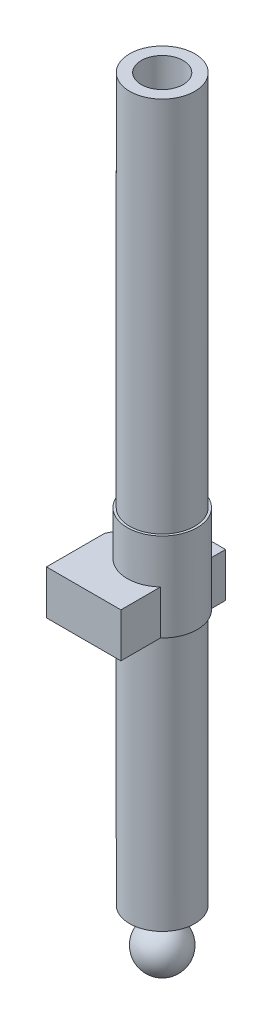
ISO-10303-21;
HEADER;
FILE_DESCRIPTION(('STEP AP214'),'2;1');
FILE_NAME('part.step','',(''),(''),'','','');
FILE_SCHEMA(('AUTOMOTIVE_DESIGN { 1 0 10303 214 1 1 1 1 }'));
ENDSEC;
DATA;
#1=APPLICATION_CONTEXT('core data for automotive mechanical design processes');
#2=APPLICATION_PROTOCOL_DEFINITION('international standard','automotive_design',2000,#1);
#3=PRODUCT_CONTEXT('',#1,'mechanical');
#4=PRODUCT('Part','Part','',(#3));
#5=PRODUCT_RELATED_PRODUCT_CATEGORY('part','',(#4));
#6=PRODUCT_DEFINITION_FORMATION('','',#4);
#7=PRODUCT_DEFINITION_CONTEXT('part definition',#1,'design');
#8=PRODUCT_DEFINITION('design','',#6,#7);
#9=PRODUCT_DEFINITION_SHAPE('','',#8);
#10=(LENGTH_UNIT() NAMED_UNIT(*) SI_UNIT(.MILLI.,.METRE.));
#11=(NAMED_UNIT(*) PLANE_ANGLE_UNIT() SI_UNIT($,.RADIAN.));
#12=(NAMED_UNIT(*) SI_UNIT($,.STERADIAN.) SOLID_ANGLE_UNIT());
#13=UNCERTAINTY_MEASURE_WITH_UNIT(LENGTH_MEASURE(1.E-05),#10,'distance_accuracy_value','');
#14=(GEOMETRIC_REPRESENTATION_CONTEXT(3) GLOBAL_UNCERTAINTY_ASSIGNED_CONTEXT((#13)) GLOBAL_UNIT_ASSIGNED_CONTEXT((#10,
#11,#12)) REPRESENTATION_CONTEXT('',''));
#15=CARTESIAN_POINT('',(0.,0.,0.));
#16=DIRECTION('',(0.,0.,1.));
#17=DIRECTION('',(1.,0.,0.));
#18=AXIS2_PLACEMENT_3D('',#15,#16,#17);
#19=CARTESIAN_POINT('',(0.,0.,0.));
#20=DIRECTION('',(0.,0.,-1.));
#21=DIRECTION('',(1.,0.,0.));
#22=AXIS2_PLACEMENT_3D('',#19,#20,#21);
#23=SPHERICAL_SURFACE('',#22,10.);
#24=CARTESIAN_POINT('',(0.,0.,0.));
#25=DIRECTION('',(0.,-1.,0.));
#26=DIRECTION('',(0.,0.,-1.));
#27=AXIS2_PLACEMENT_3D('',#24,#25,#26);
#28=SPHERICAL_SURFACE('',#27,10.);
#29=CARTESIAN_POINT('',(0.,8.73937699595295,0.));
#30=DIRECTION('',(0.,-1.,0.));
#31=DIRECTION('',(0.,0.,-1.));
#32=AXIS2_PLACEMENT_3D('',#29,#30,#31);
#33=CIRCLE('',#32,4.86037958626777);
#34=CARTESIAN_POINT('',(0.,8.73937699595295,-4.86037958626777));
#35=VERTEX_POINT('',#34);
#36=EDGE_CURVE('E163',#35,#35,#33,.T.);
#37=ORIENTED_EDGE('',*,*,#36,.T.);
#38=EDGE_LOOP('',(#37));
#39=FACE_BOUND('',#38,.T.);
#40=ADVANCED_FACE('F34',(#39),#28,.T.);
#41=CARTESIAN_POINT('',(0.,15.,0.));
#42=DIRECTION('',(0.,1.,0.));
#43=DIRECTION('',(0.,0.,1.));
#44=AXIS2_PLACEMENT_3D('',#41,#42,#43);
#45=PLANE('',#44);
#46=CARTESIAN_POINT('',(0.,15.,0.));
#47=DIRECTION('',(0.,1.,0.));
#48=DIRECTION('',(0.,0.,1.));
#49=AXIS2_PLACEMENT_3D('',#46,#47,#48);
#50=CIRCLE('',#49,7.);
#51=CARTESIAN_POINT('',(0.,15.,7.));
#52=VERTEX_POINT('',#51);
#53=EDGE_CURVE('E155',#52,#52,#50,.T.);
#54=ORIENTED_EDGE('',*,*,#53,.T.);
#55=EDGE_LOOP('',(#54));
#56=FACE_BOUND('',#55,.T.);
#57=CARTESIAN_POINT('',(0.,15.,0.));
#58=DIRECTION('',(0.,1.,0.));
#59=DIRECTION('',(0.,0.,1.));
#60=AXIS2_PLACEMENT_3D('',#57,#58,#59);
#61=CIRCLE('',#60,14.);
#62=CARTESIAN_POINT('',(0.,15.,14.));
#63=VERTEX_POINT('',#62);
#64=EDGE_CURVE('E149',#63,#63,#61,.T.);
#65=ORIENTED_EDGE('',*,*,#64,.F.);
#66=EDGE_LOOP('',(#65));
#67=FACE_BOUND('',#66,.T.);
#68=ADVANCED_FACE('F201',(#56,#67),#45,.F.);
#69=CARTESIAN_POINT('',(0.,325.,0.));
#70=DIRECTION('',(0.,-1.,0.));
#71=DIRECTION('',(0.,0.,-1.));
#72=AXIS2_PLACEMENT_3D('',#69,#70,#71);
#73=CYLINDRICAL_SURFACE('',#72,14.);
#74=CARTESIAN_POINT('',(0.,125.,0.));
#75=DIRECTION('',(0.,-1.,0.));
#76=DIRECTION('',(0.,0.,-1.));
#77=AXIS2_PLACEMENT_3D('',#74,#75,#76);
#78=CIRCLE('',#77,14.);
#79=CARTESIAN_POINT('',(0.,125.,-14.));
#80=VERTEX_POINT('',#79);
#81=EDGE_CURVE('E138',#80,#80,#78,.T.);
#82=ORIENTED_EDGE('',*,*,#81,.T.);
#83=EDGE_LOOP('',(#82));
#84=FACE_BOUND('',#83,.T.);
#85=ORIENTED_EDGE('',*,*,#64,.T.);
#86=EDGE_LOOP('',(#85));
#87=FACE_BOUND('',#86,.T.);
#88=ADVANCED_FACE('F207',(#84,#87),#73,.T.);
#89=CARTESIAN_POINT('',(0.,11.,0.));
#90=DIRECTION('',(0.,1.,0.));
#91=DIRECTION('',(0.,0.,1.));
#92=AXIS2_PLACEMENT_3D('',#89,#90,#91);
#93=TOROIDAL_SURFACE('',#92,7.,4.);
#94=CARTESIAN_POINT('',(0.,11.,0.));
#95=DIRECTION('',(0.,1.,0.));
#96=DIRECTION('',(0.,0.,1.));
#97=AXIS2_PLACEMENT_3D('',#94,#95,#96);
#98=CIRCLE('',#97,3.);
#99=CARTESIAN_POINT('',(0.,11.,3.));
#100=VERTEX_POINT('',#99);
#101=EDGE_CURVE('E160',#100,#100,#98,.F.);
#102=ORIENTED_EDGE('',*,*,#101,.F.);
#103=EDGE_LOOP('',(#102));
#104=FACE_BOUND('',#103,.T.);
#105=ORIENTED_EDGE('',*,*,#53,.F.);
#106=EDGE_LOOP('',(#105));
#107=FACE_BOUND('',#106,.T.);
#108=ADVANCED_FACE('F212',(#104,#107),#93,.F.);
#109=CARTESIAN_POINT('',(0.,12.2351277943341,0.));
#110=DIRECTION('',(0.,-1.,0.));
#111=DIRECTION('',(0.,0.,-1.));
#112=AXIS2_PLACEMENT_3D('',#109,#110,#111);
#113=TOROIDAL_SURFACE('',#112,6.80453142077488,4.);
#114=ORIENTED_EDGE('',*,*,#36,.F.);
#115=EDGE_LOOP('',(#114));
#116=FACE_BOUND('',#115,.T.);
#117=ORIENTED_EDGE('',*,*,#101,.T.);
#118=EDGE_LOOP('',(#117));
#119=FACE_BOUND('',#118,.T.);
#120=ADVANCED_FACE('F214',(#116,#119),#113,.F.);
#121=CARTESIAN_POINT('',(0.,163.,0.));
#122=DIRECTION('',(0.,-1.,0.));
#123=DIRECTION('',(0.,0.,-1.));
#124=AXIS2_PLACEMENT_3D('',#121,#122,#123);
#125=PLANE('',#124);
#126=CARTESIAN_POINT('',(0.,163.,0.));
#127=DIRECTION('',(0.,-1.,0.));
#128=DIRECTION('',(0.,0.,-1.));
#129=AXIS2_PLACEMENT_3D('',#126,#127,#128);
#130=CIRCLE('',#129,15.);
#131=CARTESIAN_POINT('',(0.,163.,-15.));
#132=VERTEX_POINT('',#131);
#133=EDGE_CURVE('E133',#132,#132,#130,.T.);
#134=ORIENTED_EDGE('',*,*,#133,.F.);
#135=EDGE_LOOP('',(#134));
#136=FACE_BOUND('',#135,.T.);
#137=CARTESIAN_POINT('',(0.,163.,0.));
#138=DIRECTION('',(0.,-1.,0.));
#139=DIRECTION('',(0.,0.,-1.));
#140=AXIS2_PLACEMENT_3D('',#137,#138,#139);
#141=CIRCLE('',#140,14.);
#142=CARTESIAN_POINT('',(0.,163.,-14.));
#143=VERTEX_POINT('',#142);
#144=EDGE_CURVE('E142',#143,#143,#141,.T.);
#145=ORIENTED_EDGE('',*,*,#144,.T.);
#146=EDGE_LOOP('',(#145));
#147=FACE_BOUND('',#146,.T.);
#148=ADVANCED_FACE('F217',(#136,#147),#125,.F.);
#149=CARTESIAN_POINT('',(0.,125.,0.));
#150=DIRECTION('',(0.,-1.,0.));
#151=DIRECTION('',(0.,0.,-1.));
#152=AXIS2_PLACEMENT_3D('',#149,#150,#151);
#153=PLANE('',#152);
#154=ORIENTED_EDGE('',*,*,#81,.F.);
#155=EDGE_LOOP('',(#154));
#156=FACE_BOUND('',#155,.T.);
#157=DIRECTION('',(0.,0.,1.));
#158=VECTOR('',#157,1.);
#159=CARTESIAN_POINT('',(-21.7772956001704,125.,-17.));
#160=LINE('',#159,#158);
#161=CARTESIAN_POINT('',(-21.7772956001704,125.,3.00000000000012));
#162=VERTEX_POINT('',#161);
#163=CARTESIAN_POINT('',(-21.7772956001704,125.,28.));
#164=VERTEX_POINT('',#163);
#165=EDGE_CURVE('E113',#162,#164,#160,.T.);
#166=ORIENTED_EDGE('',*,*,#165,.F.);
#167=DIRECTION('',(-0.447213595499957,0.,0.894427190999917));
#168=VECTOR('',#167,1.);
#169=CARTESIAN_POINT('',(-16.2218364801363,125.,-8.11091824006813));
#170=LINE('',#169,#168);
#171=CARTESIAN_POINT('',(-11.7772956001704,125.,-17.));
#172=VERTEX_POINT('',#171);
#173=EDGE_CURVE('E57',#162,#172,#170,.F.);
#174=ORIENTED_EDGE('',*,*,#173,.T.);
#175=DIRECTION('',(1.,0.,0.));
#176=VECTOR('',#175,1.);
#177=CARTESIAN_POINT('',(-21.7772956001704,125.,-17.));
#178=LINE('',#177,#176);
#179=CARTESIAN_POINT('',(10.2227043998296,125.,-17.));
#180=VERTEX_POINT('',#179);
#181=EDGE_CURVE('E90',#172,#180,#178,.T.);
#182=ORIENTED_EDGE('',*,*,#181,.T.);
#183=DIRECTION('',(0.,0.,1.));
#184=VECTOR('',#183,1.);
#185=CARTESIAN_POINT('',(10.2227043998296,125.,-17.));
#186=LINE('',#185,#184);
#187=CARTESIAN_POINT('',(10.2227043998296,125.,-10.9770813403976));
#188=VERTEX_POINT('',#187);
#189=EDGE_CURVE('E94',#180,#188,#186,.T.);
#190=ORIENTED_EDGE('',*,*,#189,.T.);
#191=CARTESIAN_POINT('',(0.,125.,0.));
#192=DIRECTION('',(0.,-1.,0.));
#193=DIRECTION('',(0.,0.,-1.));
#194=AXIS2_PLACEMENT_3D('',#191,#192,#193);
#195=CIRCLE('',#194,15.);
#196=CARTESIAN_POINT('',(10.2227043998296,125.,10.9770813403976));
#197=VERTEX_POINT('',#196);
#198=EDGE_CURVE('E129',#188,#197,#195,.T.);
#199=ORIENTED_EDGE('',*,*,#198,.T.);
#200=CARTESIAN_POINT('',(10.2227043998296,125.,28.));
#201=VERTEX_POINT('',#200);
#202=EDGE_CURVE('E108',#197,#201,#186,.T.);
#203=ORIENTED_EDGE('',*,*,#202,.T.);
#204=DIRECTION('',(1.,0.,0.));
#205=VECTOR('',#204,1.);
#206=CARTESIAN_POINT('',(-21.7772956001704,125.,28.));
#207=LINE('',#206,#205);
#208=EDGE_CURVE('E119',#164,#201,#207,.T.);
#209=ORIENTED_EDGE('',*,*,#208,.F.);
#210=EDGE_LOOP('',(#166,#174,#182,#190,#199,#203,#209));
#211=FACE_BOUND('',#210,.T.);
#212=ADVANCED_FACE('F92',(#156,#211),#153,.T.);
#213=CARTESIAN_POINT('',(0.,163.,0.));
#214=DIRECTION('',(0.,-1.,0.));
#215=DIRECTION('',(0.,0.,-1.));
#216=AXIS2_PLACEMENT_3D('',#213,#214,#215);
#217=CYLINDRICAL_SURFACE('',#216,15.);
#218=DIRECTION('',(0.,-1.,0.));
#219=VECTOR('',#218,1.);
#220=CARTESIAN_POINT('',(10.2227043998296,163.,10.9770813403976));
#221=LINE('',#220,#219);
#222=CARTESIAN_POINT('',(10.2227043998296,144.,10.9770813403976));
#223=VERTEX_POINT('',#222);
#224=EDGE_CURVE('E173',#197,#223,#221,.F.);
#225=ORIENTED_EDGE('',*,*,#224,.F.);
#226=ORIENTED_EDGE('',*,*,#198,.F.);
#227=DIRECTION('',(0.,-1.,0.));
#228=VECTOR('',#227,1.);
#229=CARTESIAN_POINT('',(10.2227043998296,163.,-10.9770813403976));
#230=LINE('',#229,#228);
#231=CARTESIAN_POINT('',(10.2227043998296,144.,-10.9770813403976));
#232=VERTEX_POINT('',#231);
#233=EDGE_CURVE('E105',#232,#188,#230,.T.);
#234=ORIENTED_EDGE('',*,*,#233,.F.);
#235=CARTESIAN_POINT('',(0.,144.,0.));
#236=DIRECTION('',(0.,1.,0.));
#237=DIRECTION('',(0.,0.,1.));
#238=AXIS2_PLACEMENT_3D('',#235,#236,#237);
#239=CIRCLE('',#238,15.);
#240=EDGE_CURVE('E171',#223,#232,#239,.F.);
#241=ORIENTED_EDGE('',*,*,#240,.F.);
#242=EDGE_LOOP('',(#225,#226,#234,#241));
#243=FACE_BOUND('',#242,.T.);
#244=ORIENTED_EDGE('',*,*,#133,.T.);
#245=EDGE_LOOP('',(#244));
#246=FACE_BOUND('',#245,.T.);
#247=ADVANCED_FACE('F240',(#243,#246),#217,.T.);
#248=CARTESIAN_POINT('',(0.,325.,0.));
#249=DIRECTION('',(0.,1.,0.));
#250=DIRECTION('',(0.,0.,1.));
#251=AXIS2_PLACEMENT_3D('',#248,#249,#250);
#252=CIRCLE('',#251,14.);
#253=CARTESIAN_POINT('',(0.,325.,14.));
#254=VERTEX_POINT('',#253);
#255=EDGE_CURVE('E152',#254,#254,#252,.T.);
#256=ORIENTED_EDGE('',*,*,#255,.F.);
#257=EDGE_LOOP('',(#256));
#258=FACE_BOUND('',#257,.T.);
#259=ORIENTED_EDGE('',*,*,#144,.F.);
#260=EDGE_LOOP('',(#259));
#261=FACE_BOUND('',#260,.T.);
#262=ADVANCED_FACE('F235',(#258,#261),#73,.T.);
#263=CARTESIAN_POINT('',(0.,325.,0.));
#264=DIRECTION('',(0.,1.,0.));
#265=DIRECTION('',(0.,0.,1.));
#266=AXIS2_PLACEMENT_3D('',#263,#264,#265);
#267=PLANE('',#266);
#268=CARTESIAN_POINT('',(0.,325.,0.));
#269=DIRECTION('',(0.,1.,0.));
#270=DIRECTION('',(0.,0.,1.));
#271=AXIS2_PLACEMENT_3D('',#268,#269,#270);
#272=CIRCLE('',#271,9.);
#273=CARTESIAN_POINT('',(0.,325.,9.));
#274=VERTEX_POINT('',#273);
#275=EDGE_CURVE('E141',#274,#274,#272,.T.);
#276=ORIENTED_EDGE('',*,*,#275,.F.);
#277=EDGE_LOOP('',(#276));
#278=FACE_BOUND('',#277,.T.);
#279=ORIENTED_EDGE('',*,*,#255,.T.);
#280=EDGE_LOOP('',(#279));
#281=FACE_BOUND('',#280,.T.);
#282=ADVANCED_FACE('F239',(#278,#281),#267,.T.);
#283=CARTESIAN_POINT('',(0.,105.,0.));
#284=DIRECTION('',(0.,1.,0.));
#285=DIRECTION('',(0.,0.,1.));
#286=AXIS2_PLACEMENT_3D('',#283,#284,#285);
#287=CYLINDRICAL_SURFACE('',#286,9.);
#288=ORIENTED_EDGE('',*,*,#275,.T.);
#289=EDGE_LOOP('',(#288));
#290=FACE_BOUND('',#289,.T.);
#291=CARTESIAN_POINT('',(0.,163.,0.));
#292=DIRECTION('',(0.,-1.,0.));
#293=DIRECTION('',(0.,0.,-1.));
#294=AXIS2_PLACEMENT_3D('',#291,#292,#293);
#295=CIRCLE('',#294,9.);
#296=CARTESIAN_POINT('',(0.,163.,-9.));
#297=VERTEX_POINT('',#296);
#298=EDGE_CURVE('E145',#297,#297,#295,.F.);
#299=ORIENTED_EDGE('',*,*,#298,.F.);
#300=EDGE_LOOP('',(#299));
#301=FACE_BOUND('',#300,.T.);
#302=ADVANCED_FACE('F246',(#290,#301),#287,.F.);
#303=ORIENTED_EDGE('',*,*,#298,.T.);
#304=EDGE_LOOP('',(#303));
#305=FACE_BOUND('',#304,.T.);
#306=ADVANCED_FACE('F224',(#305),#125,.F.);
#307=CARTESIAN_POINT('',(10.2227043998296,125.,-17.));
#308=DIRECTION('',(1.,0.,0.));
#309=DIRECTION('',(0.,0.,-1.));
#310=AXIS2_PLACEMENT_3D('',#307,#308,#309);
#311=PLANE('',#310);
#312=ORIENTED_EDGE('',*,*,#202,.F.);
#313=ORIENTED_EDGE('',*,*,#224,.T.);
#314=DIRECTION('',(0.,0.,1.));
#315=VECTOR('',#314,1.);
#316=CARTESIAN_POINT('',(10.2227043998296,144.,-17.));
#317=LINE('',#316,#315);
#318=CARTESIAN_POINT('',(10.2227043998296,144.,28.));
#319=VERTEX_POINT('',#318);
#320=EDGE_CURVE('E107',#223,#319,#317,.T.);
#321=ORIENTED_EDGE('',*,*,#320,.T.);
#322=DIRECTION('',(0.,1.,0.));
#323=VECTOR('',#322,1.);
#324=CARTESIAN_POINT('',(10.2227043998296,125.,28.));
#325=LINE('',#324,#323);
#326=EDGE_CURVE('E122',#201,#319,#325,.T.);
#327=ORIENTED_EDGE('',*,*,#326,.F.);
#328=EDGE_LOOP('',(#312,#313,#321,#327));
#329=FACE_BOUND('',#328,.T.);
#330=ADVANCED_FACE('F282',(#329),#311,.T.);
#331=CARTESIAN_POINT('',(-21.7772956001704,125.,-17.));
#332=DIRECTION('',(-1.,0.,0.));
#333=DIRECTION('',(0.,0.,1.));
#334=AXIS2_PLACEMENT_3D('',#331,#332,#333);
#335=PLANE('',#334);
#336=DIRECTION('',(0.,0.,1.));
#337=VECTOR('',#336,1.);
#338=CARTESIAN_POINT('',(-21.7772956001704,144.,-17.));
#339=LINE('',#338,#337);
#340=CARTESIAN_POINT('',(-21.7772956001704,144.,3.00000000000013));
#341=VERTEX_POINT('',#340);
#342=CARTESIAN_POINT('',(-21.7772956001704,144.,28.));
#343=VERTEX_POINT('',#342);
#344=EDGE_CURVE('E127',#341,#343,#339,.T.);
#345=ORIENTED_EDGE('',*,*,#344,.F.);
#346=DIRECTION('',(0.,-1.,0.));
#347=VECTOR('',#346,1.);
#348=CARTESIAN_POINT('',(-21.7772956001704,125.,3.00000000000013));
#349=LINE('',#348,#347);
#350=EDGE_CURVE('E175',#341,#162,#349,.T.);
#351=ORIENTED_EDGE('',*,*,#350,.T.);
#352=ORIENTED_EDGE('',*,*,#165,.T.);
#353=DIRECTION('',(0.,-1.,0.));
#354=VECTOR('',#353,1.);
#355=CARTESIAN_POINT('',(-21.7772956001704,125.,28.));
#356=LINE('',#355,#354);
#357=EDGE_CURVE('E116',#343,#164,#356,.T.);
#358=ORIENTED_EDGE('',*,*,#357,.F.);
#359=EDGE_LOOP('',(#345,#351,#352,#358));
#360=FACE_BOUND('',#359,.T.);
#361=ADVANCED_FACE('F181',(#360),#335,.T.);
#362=CARTESIAN_POINT('',(-21.7772956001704,144.,-17.));
#363=DIRECTION('',(0.,1.,0.));
#364=DIRECTION('',(0.,0.,1.));
#365=AXIS2_PLACEMENT_3D('',#362,#363,#364);
#366=PLANE('',#365);
#367=DIRECTION('',(-1.,0.,0.));
#368=VECTOR('',#367,1.);
#369=CARTESIAN_POINT('',(-21.7772956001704,144.,-17.));
#370=LINE('',#369,#368);
#371=CARTESIAN_POINT('',(10.2227043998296,144.,-17.));
#372=VERTEX_POINT('',#371);
#373=CARTESIAN_POINT('',(-11.7772956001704,144.,-17.));
#374=VERTEX_POINT('',#373);
#375=EDGE_CURVE('E111',#372,#374,#370,.T.);
#376=ORIENTED_EDGE('',*,*,#375,.T.);
#377=DIRECTION('',(0.447213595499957,0.,-0.894427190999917));
#378=VECTOR('',#377,1.);
#379=CARTESIAN_POINT('',(-13.7772956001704,144.,-13.));
#380=LINE('',#379,#378);
#381=EDGE_CURVE('E11',#374,#341,#380,.F.);
#382=ORIENTED_EDGE('',*,*,#381,.T.);
#383=ORIENTED_EDGE('',*,*,#344,.T.);
#384=DIRECTION('',(-1.,0.,0.));
#385=VECTOR('',#384,1.);
#386=CARTESIAN_POINT('',(-21.7772956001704,144.,28.));
#387=LINE('',#386,#385);
#388=EDGE_CURVE('E98',#319,#343,#387,.T.);
#389=ORIENTED_EDGE('',*,*,#388,.F.);
#390=ORIENTED_EDGE('',*,*,#320,.F.);
#391=ORIENTED_EDGE('',*,*,#240,.T.);
#392=EDGE_CURVE('E130',#372,#232,#317,.T.);
#393=ORIENTED_EDGE('',*,*,#392,.F.);
#394=EDGE_LOOP('',(#376,#382,#383,#389,#390,#391,#393));
#395=FACE_BOUND('',#394,.T.);
#396=ADVANCED_FACE('F192',(#395),#366,.T.);
#397=ORIENTED_EDGE('',*,*,#392,.T.);
#398=ORIENTED_EDGE('',*,*,#233,.T.);
#399=ORIENTED_EDGE('',*,*,#189,.F.);
#400=DIRECTION('',(0.,1.,0.));
#401=VECTOR('',#400,1.);
#402=CARTESIAN_POINT('',(10.2227043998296,125.,-17.));
#403=LINE('',#402,#401);
#404=EDGE_CURVE('E97',#180,#372,#403,.T.);
#405=ORIENTED_EDGE('',*,*,#404,.T.);
#406=EDGE_LOOP('',(#397,#398,#399,#405));
#407=FACE_BOUND('',#406,.T.);
#408=ADVANCED_FACE('F103',(#407),#311,.T.);
#409=CARTESIAN_POINT('',(-21.7772956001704,144.,-17.));
#410=DIRECTION('',(0.,0.,-1.));
#411=DIRECTION('',(-1.,0.,0.));
#412=AXIS2_PLACEMENT_3D('',#409,#410,#411);
#413=PLANE('',#412);
#414=ORIENTED_EDGE('',*,*,#181,.F.);
#415=DIRECTION('',(0.,1.,0.));
#416=VECTOR('',#415,1.);
#417=CARTESIAN_POINT('',(-11.7772956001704,144.,-17.));
#418=LINE('',#417,#416);
#419=EDGE_CURVE('E43',#172,#374,#418,.T.);
#420=ORIENTED_EDGE('',*,*,#419,.T.);
#421=ORIENTED_EDGE('',*,*,#375,.F.);
#422=ORIENTED_EDGE('',*,*,#404,.F.);
#423=EDGE_LOOP('',(#414,#420,#421,#422));
#424=FACE_BOUND('',#423,.T.);
#425=ADVANCED_FACE('F110',(#424),#413,.T.);
#426=CARTESIAN_POINT('',(-21.7772956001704,144.,28.));
#427=DIRECTION('',(0.,0.,-1.));
#428=DIRECTION('',(-1.,0.,0.));
#429=AXIS2_PLACEMENT_3D('',#426,#427,#428);
#430=PLANE('',#429);
#431=ORIENTED_EDGE('',*,*,#357,.T.);
#432=ORIENTED_EDGE('',*,*,#208,.T.);
#433=ORIENTED_EDGE('',*,*,#326,.T.);
#434=ORIENTED_EDGE('',*,*,#388,.T.);
#435=EDGE_LOOP('',(#431,#432,#433,#434));
#436=FACE_BOUND('',#435,.T.);
#437=ADVANCED_FACE('F188',(#436),#430,.F.);
#438=CARTESIAN_POINT('',(-21.7772956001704,125.,3.00000000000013));
#439=DIRECTION('',(0.894427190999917,0.,0.447213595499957));
#440=DIRECTION('',(0.447213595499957,0.,-0.894427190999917));
#441=AXIS2_PLACEMENT_3D('',#438,#439,#440);
#442=PLANE('',#441);
#443=ORIENTED_EDGE('',*,*,#381,.F.);
#444=ORIENTED_EDGE('',*,*,#419,.F.);
#445=ORIENTED_EDGE('',*,*,#173,.F.);
#446=ORIENTED_EDGE('',*,*,#350,.F.);
#447=EDGE_LOOP('',(#443,#444,#445,#446));
#448=FACE_BOUND('',#447,.T.);
#449=ADVANCED_FACE('F36',(#448),#442,.F.);
#450=CLOSED_SHELL('',(#40,#68,#88,#108,#120,#148,#212,#247,#262,#282,#302,#306,#330,#361,#396,
#408,#425,#437,#449));
#451=CARTESIAN_POINT('',(0.,105.,0.));
#452=DIRECTION('',(0.,1.,0.));
#453=DIRECTION('',(0.,0.,1.));
#454=AXIS2_PLACEMENT_3D('',#451,#452,#453);
#455=PLANE('',#454);
#456=CARTESIAN_POINT('',(0.,105.,0.));
#457=DIRECTION('',(0.,1.,0.));
#458=DIRECTION('',(0.,0.,1.));
#459=AXIS2_PLACEMENT_3D('',#456,#457,#458);
#460=CIRCLE('',#459,9.);
#461=CARTESIAN_POINT('',(0.,105.,9.));
#462=VERTEX_POINT('',#461);
#463=EDGE_CURVE('E146',#462,#462,#460,.T.);
#464=ORIENTED_EDGE('',*,*,#463,.T.);
#465=EDGE_LOOP('',(#464));
#466=FACE_BOUND('',#465,.T.);
#467=ADVANCED_FACE('F265',(#466),#455,.T.);
#468=CARTESIAN_POINT('',(0.,125.,0.));
#469=DIRECTION('',(0.,-1.,0.));
#470=DIRECTION('',(0.,0.,-1.));
#471=AXIS2_PLACEMENT_3D('',#468,#469,#470);
#472=CIRCLE('',#471,9.);
#473=CARTESIAN_POINT('',(0.,125.,-9.));
#474=VERTEX_POINT('',#473);
#475=EDGE_CURVE('E136',#474,#474,#472,.F.);
#476=ORIENTED_EDGE('',*,*,#475,.T.);
#477=EDGE_LOOP('',(#476));
#478=FACE_BOUND('',#477,.T.);
#479=ORIENTED_EDGE('',*,*,#463,.F.);
#480=EDGE_LOOP('',(#479));
#481=FACE_BOUND('',#480,.T.);
#482=ADVANCED_FACE('F267',(#478,#481),#287,.F.);
#483=ORIENTED_EDGE('',*,*,#475,.F.);
#484=EDGE_LOOP('',(#483));
#485=FACE_BOUND('',#484,.T.);
#486=ADVANCED_FACE('F261',(#485),#153,.T.);
#487=CLOSED_SHELL('',(#467,#482,#486));
#488=ORIENTED_CLOSED_SHELL('',*,#487,.T.);
#489=BREP_WITH_VOIDS('B2',#450,(#488));
#490=ADVANCED_BREP_SHAPE_REPRESENTATION('',(#18,#489),#14);
#491=SHAPE_DEFINITION_REPRESENTATION(#9,#490);
ENDSEC;
END-ISO-10303-21;
